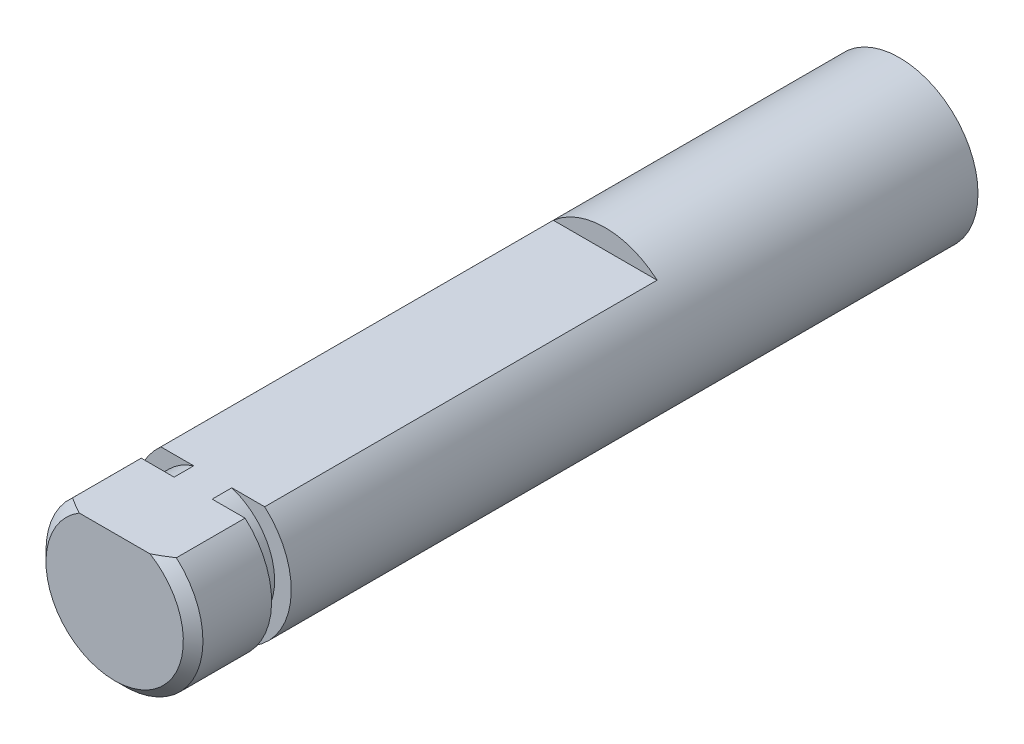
from build123d import *

# Parameters (mm, degrees)
ESQUISSE1_R             = 4
EXTRUSION1_DEPTH        = 40
ESQUISSE2_W             = 5.561833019
ESQUISSE2_H             = 1
ENL_V_MAT_EXTRU_1_DEPTH = 25
ESQUISSE3_W             = 1
ESQUISSE3_H             = 1.843291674
CHANFREIN1_SIZE         = 0.5


with BuildPart() as part:
    # Esquisse1 → Extrusion1 (new body)
    with BuildSketch(Plane.XY):
        Circle(ESQUISSE1_R)
    extrude(amount=EXTRUSION1_DEPTH)

    # Esquisse2 → Enl_v. mat.-Extru.1 (cut)
    with BuildSketch(Plane.XY.offset(40)):
        with Locations((-0.106716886, 3.5)):
            Rectangle(ESQUISSE2_W, ESQUISSE2_H)
    extrude(amount=-ENL_V_MAT_EXTRU_1_DEPTH, mode=Mode.SUBTRACT)

    # Esquisse3 → Enl_vement de mati_re-R_volution1 (revolve, cut)
    with BuildSketch(Plane(origin=(0, 0, 0), x_dir=(0, 0, -1), z_dir=(1, 0, 0)), mode=Mode.PRIVATE) as enl_vement_de_mati_re_r_volution1_sk:
        with Locations((-35.5, -4.074644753)):
            Rectangle(ESQUISSE3_W, ESQUISSE3_H)
    revolve(enl_vement_de_mati_re_r_volution1_sk.sketch.rotate(Axis((0, 0, 40), (0, 0, -1)), 138.590377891), axis=Axis((0, 0, 40), (0, 0, -1)), mode=Mode.SUBTRACT)

    # Chanfrein1
    chanfrein1_edges = [part.edges().sort_by_distance(p)[0] for p in [
        (0, -4, 40),
    ]]
    chamfer(chanfrein1_edges, length=CHANFREIN1_SIZE)


solid = part.part
